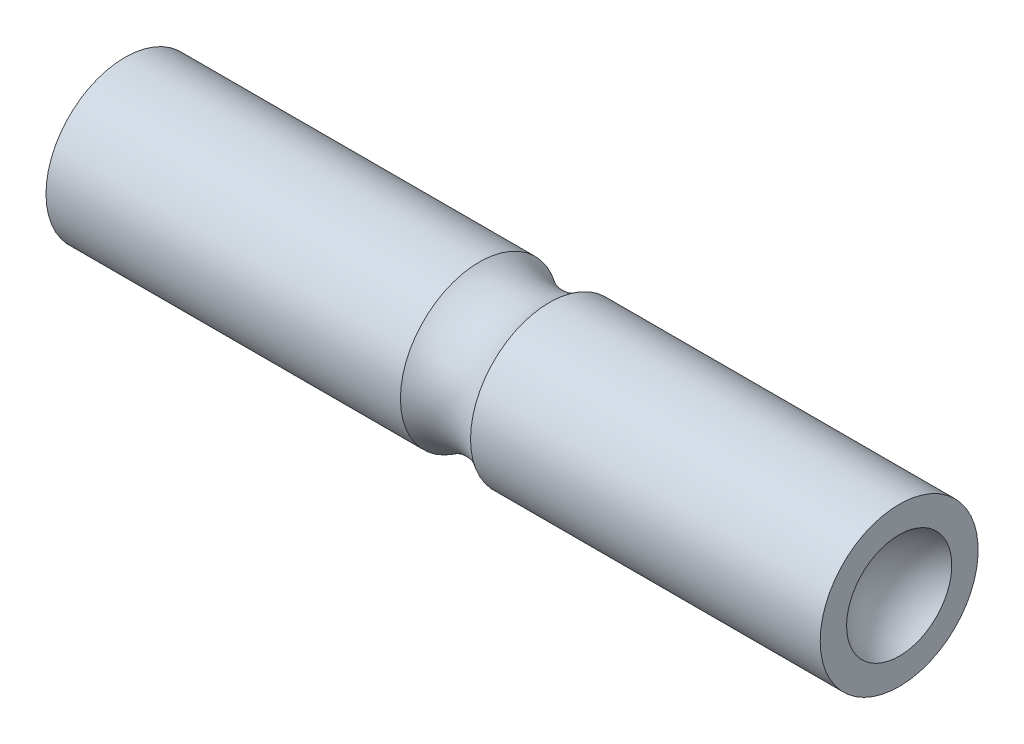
from build123d import *


with BuildPart() as part:
    # Sketch1 → Revolve1 (revolve)
    with BuildSketch(Plane.XY, mode=Mode.PRIVATE) as revolve1_sk:
        with BuildLine():
            ThreePointArc((0.515628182, 1.9812), (0.131019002, 1.023599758), (0, 0))
            Line((0, 0), (19.177, 0))
            ThreePointArc((19.177, 0), (19.381177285, 0.762), (19.939, 1.319822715))
            Line((19.939, 1.319822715), (19.939, 1.9812))
            Line((19.939, 1.9812), (11.166515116, 1.9812))
            ThreePointArc((11.166515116, 1.9812), (10.287, 1.7018), (9.407484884, 1.9812))
            Line((9.407484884, 1.9812), (0.515628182, 1.9812))
        make_face()
    revolve(revolve1_sk.sketch.rotate(Axis((0.733818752, 0, 0), (1, 0, 0)), 90), axis=Axis((0.733818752, 0, 0), (1, 0, 0)))


solid = part.part
